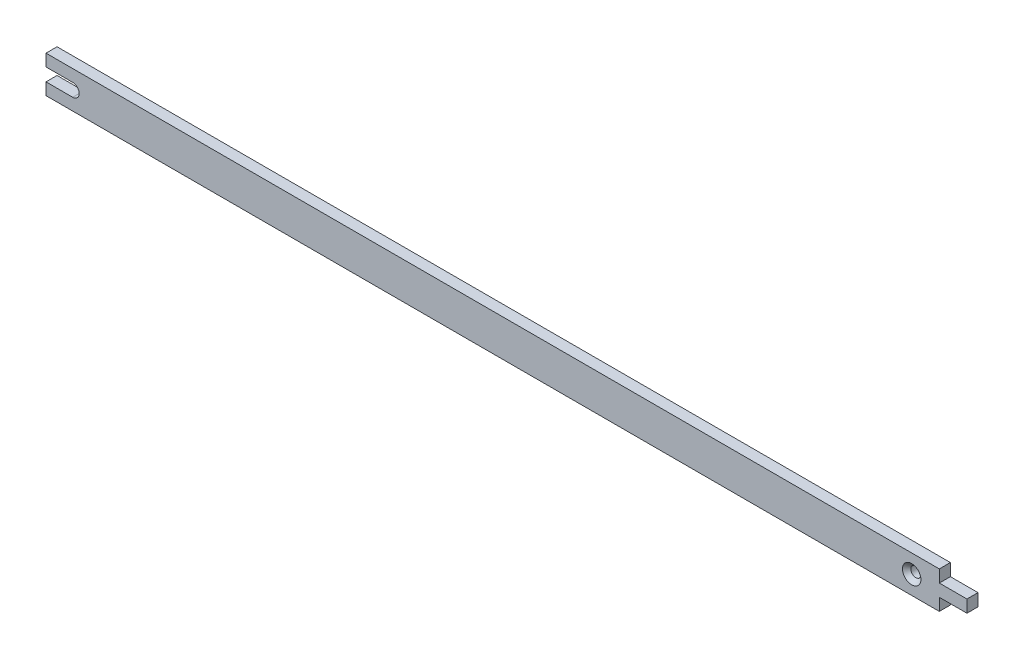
ISO-10303-21;
HEADER;
FILE_DESCRIPTION(('STEP AP214'),'2;1');
FILE_NAME('part.step','',(''),(''),'','','');
FILE_SCHEMA(('AUTOMOTIVE_DESIGN { 1 0 10303 214 1 1 1 1 }'));
ENDSEC;
DATA;
#1=APPLICATION_CONTEXT('core data for automotive mechanical design processes');
#2=APPLICATION_PROTOCOL_DEFINITION('international standard','automotive_design',2000,#1);
#3=PRODUCT_CONTEXT('',#1,'mechanical');
#4=PRODUCT('Part','Part','',(#3));
#5=PRODUCT_RELATED_PRODUCT_CATEGORY('part','',(#4));
#6=PRODUCT_DEFINITION_FORMATION('','',#4);
#7=PRODUCT_DEFINITION_CONTEXT('part definition',#1,'design');
#8=PRODUCT_DEFINITION('design','',#6,#7);
#9=PRODUCT_DEFINITION_SHAPE('','',#8);
#10=(LENGTH_UNIT() NAMED_UNIT(*) SI_UNIT(.MILLI.,.METRE.));
#11=(NAMED_UNIT(*) PLANE_ANGLE_UNIT() SI_UNIT($,.RADIAN.));
#12=(NAMED_UNIT(*) SI_UNIT($,.STERADIAN.) SOLID_ANGLE_UNIT());
#13=UNCERTAINTY_MEASURE_WITH_UNIT(LENGTH_MEASURE(1.E-05),#10,'distance_accuracy_value','');
#14=(GEOMETRIC_REPRESENTATION_CONTEXT(3) GLOBAL_UNCERTAINTY_ASSIGNED_CONTEXT((#13)) GLOBAL_UNIT_ASSIGNED_CONTEXT((#10,
#11,#12)) REPRESENTATION_CONTEXT('',''));
#15=CARTESIAN_POINT('',(0.,0.,0.));
#16=DIRECTION('',(0.,0.,1.));
#17=DIRECTION('',(1.,0.,0.));
#18=AXIS2_PLACEMENT_3D('',#15,#16,#17);
#19=CARTESIAN_POINT('',(15.,3.5,6.));
#20=DIRECTION('',(0.,0.,1.));
#21=DIRECTION('',(0.,1.,0.));
#22=AXIS2_PLACEMENT_3D('',#19,#20,#21);
#23=PLANE('',#22);
#24=DIRECTION('',(0.,1.,0.));
#25=VECTOR('',#24,1.);
#26=CARTESIAN_POINT('',(-470.,-43.8145907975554,6.));
#27=LINE('',#26,#25);
#28=CARTESIAN_POINT('',(-470.,-10.,6.));
#29=VERTEX_POINT('',#28);
#30=CARTESIAN_POINT('',(-470.,-3.5,6.));
#31=VERTEX_POINT('',#30);
#32=EDGE_CURVE('E105',#29,#31,#27,.T.);
#33=ORIENTED_EDGE('',*,*,#32,.F.);
#34=DIRECTION('',(1.,0.,0.));
#35=VECTOR('',#34,1.);
#36=CARTESIAN_POINT('',(15.,-10.,6.));
#37=LINE('',#36,#35);
#38=CARTESIAN_POINT('',(15.,-10.,6.));
#39=VERTEX_POINT('',#38);
#40=EDGE_CURVE('E116',#29,#39,#37,.T.);
#41=ORIENTED_EDGE('',*,*,#40,.T.);
#42=DIRECTION('',(0.,1.,0.));
#43=VECTOR('',#42,1.);
#44=CARTESIAN_POINT('',(15.,-3.35,6.));
#45=LINE('',#44,#43);
#46=CARTESIAN_POINT('',(15.,-3.35,6.));
#47=VERTEX_POINT('',#46);
#48=EDGE_CURVE('E128',#39,#47,#45,.T.);
#49=ORIENTED_EDGE('',*,*,#48,.T.);
#50=DIRECTION('',(1.,0.,0.));
#51=VECTOR('',#50,1.);
#52=CARTESIAN_POINT('',(30.,-3.35,6.));
#53=LINE('',#52,#51);
#54=CARTESIAN_POINT('',(30.,-3.35,6.));
#55=VERTEX_POINT('',#54);
#56=EDGE_CURVE('E131',#47,#55,#53,.T.);
#57=ORIENTED_EDGE('',*,*,#56,.T.);
#58=DIRECTION('',(0.,1.,0.));
#59=VECTOR('',#58,1.);
#60=CARTESIAN_POINT('',(30.,-3.35,6.));
#61=LINE('',#60,#59);
#62=CARTESIAN_POINT('',(30.,3.35,6.));
#63=VERTEX_POINT('',#62);
#64=EDGE_CURVE('E34',#55,#63,#61,.T.);
#65=ORIENTED_EDGE('',*,*,#64,.T.);
#66=DIRECTION('',(-1.,0.,0.));
#67=VECTOR('',#66,1.);
#68=CARTESIAN_POINT('',(30.,3.35,6.));
#69=LINE('',#68,#67);
#70=CARTESIAN_POINT('',(15.,3.35,6.));
#71=VERTEX_POINT('',#70);
#72=EDGE_CURVE('E29',#63,#71,#69,.T.);
#73=ORIENTED_EDGE('',*,*,#72,.T.);
#74=DIRECTION('',(0.,1.,0.));
#75=VECTOR('',#74,1.);
#76=CARTESIAN_POINT('',(15.,3.35,6.));
#77=LINE('',#76,#75);
#78=CARTESIAN_POINT('',(15.,10.,6.));
#79=VERTEX_POINT('',#78);
#80=EDGE_CURVE('E134',#71,#79,#77,.T.);
#81=ORIENTED_EDGE('',*,*,#80,.T.);
#82=DIRECTION('',(-1.,0.,0.));
#83=VECTOR('',#82,1.);
#84=CARTESIAN_POINT('',(15.,10.,6.));
#85=LINE('',#84,#83);
#86=CARTESIAN_POINT('',(-470.,10.,6.));
#87=VERTEX_POINT('',#86);
#88=EDGE_CURVE('E129',#79,#87,#85,.T.);
#89=ORIENTED_EDGE('',*,*,#88,.T.);
#90=CARTESIAN_POINT('',(-470.,3.5,6.));
#91=VERTEX_POINT('',#90);
#92=EDGE_CURVE('E122',#91,#87,#27,.T.);
#93=ORIENTED_EDGE('',*,*,#92,.F.);
#94=DIRECTION('',(-1.,0.,0.));
#95=VECTOR('',#94,1.);
#96=CARTESIAN_POINT('',(-455.5,3.5,6.));
#97=LINE('',#96,#95);
#98=CARTESIAN_POINT('',(-455.5,3.5,6.));
#99=VERTEX_POINT('',#98);
#100=EDGE_CURVE('E267',#99,#91,#97,.T.);
#101=ORIENTED_EDGE('',*,*,#100,.F.);
#102=CARTESIAN_POINT('',(-455.5,0.,6.));
#103=DIRECTION('',(0.,0.,1.));
#104=DIRECTION('',(-1.,0.,0.));
#105=AXIS2_PLACEMENT_3D('',#102,#103,#104);
#106=CIRCLE('',#105,3.5);
#107=CARTESIAN_POINT('',(-455.5,-3.5,6.));
#108=VERTEX_POINT('',#107);
#109=EDGE_CURVE('E264',#108,#99,#106,.T.);
#110=ORIENTED_EDGE('',*,*,#109,.F.);
#111=DIRECTION('',(1.,0.,0.));
#112=VECTOR('',#111,1.);
#113=CARTESIAN_POINT('',(-470.,-3.5,6.));
#114=LINE('',#113,#112);
#115=EDGE_CURVE('E120',#31,#108,#114,.T.);
#116=ORIENTED_EDGE('',*,*,#115,.F.);
#117=EDGE_LOOP('',(#33,#41,#49,#57,#65,#73,#81,#89,#93,#101,#110,#116));
#118=FACE_BOUND('',#117,.T.);
#119=CARTESIAN_POINT('',(0.,0.,6.));
#120=DIRECTION('',(0.,0.,1.));
#121=DIRECTION('',(0.,1.,0.));
#122=AXIS2_PLACEMENT_3D('',#119,#120,#121);
#123=CIRCLE('',#122,5.);
#124=CARTESIAN_POINT('',(0.,5.,6.));
#125=VERTEX_POINT('',#124);
#126=EDGE_CURVE('E9',#125,#125,#123,.F.);
#127=ORIENTED_EDGE('',*,*,#126,.T.);
#128=EDGE_LOOP('',(#127));
#129=FACE_BOUND('',#128,.T.);
#130=ADVANCED_FACE('F14',(#118,#129),#23,.T.);
#131=CARTESIAN_POINT('',(15.,3.5,0.));
#132=DIRECTION('',(0.,0.,1.));
#133=DIRECTION('',(0.,1.,0.));
#134=AXIS2_PLACEMENT_3D('',#131,#132,#133);
#135=PLANE('',#134);
#136=DIRECTION('',(1.,0.,0.));
#137=VECTOR('',#136,1.);
#138=CARTESIAN_POINT('',(15.,-10.,0.));
#139=LINE('',#138,#137);
#140=CARTESIAN_POINT('',(-470.,-10.,0.));
#141=VERTEX_POINT('',#140);
#142=CARTESIAN_POINT('',(15.,-10.,0.));
#143=VERTEX_POINT('',#142);
#144=EDGE_CURVE('E220',#141,#143,#139,.T.);
#145=ORIENTED_EDGE('',*,*,#144,.F.);
#146=DIRECTION('',(0.,1.,0.));
#147=VECTOR('',#146,1.);
#148=CARTESIAN_POINT('',(-470.,-43.8145907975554,0.));
#149=LINE('',#148,#147);
#150=CARTESIAN_POINT('',(-470.,-3.5,0.));
#151=VERTEX_POINT('',#150);
#152=EDGE_CURVE('E108',#141,#151,#149,.T.);
#153=ORIENTED_EDGE('',*,*,#152,.T.);
#154=DIRECTION('',(1.,0.,0.));
#155=VECTOR('',#154,1.);
#156=CARTESIAN_POINT('',(-470.,-3.5,0.));
#157=LINE('',#156,#155);
#158=CARTESIAN_POINT('',(-455.5,-3.5,0.));
#159=VERTEX_POINT('',#158);
#160=EDGE_CURVE('E248',#151,#159,#157,.T.);
#161=ORIENTED_EDGE('',*,*,#160,.T.);
#162=CARTESIAN_POINT('',(-455.5,0.,0.));
#163=DIRECTION('',(0.,0.,1.));
#164=DIRECTION('',(-1.,0.,0.));
#165=AXIS2_PLACEMENT_3D('',#162,#163,#164);
#166=CIRCLE('',#165,3.5);
#167=CARTESIAN_POINT('',(-455.5,3.5,0.));
#168=VERTEX_POINT('',#167);
#169=EDGE_CURVE('E260',#159,#168,#166,.T.);
#170=ORIENTED_EDGE('',*,*,#169,.T.);
#171=DIRECTION('',(-1.,0.,0.));
#172=VECTOR('',#171,1.);
#173=CARTESIAN_POINT('',(-455.5,3.5,0.));
#174=LINE('',#173,#172);
#175=CARTESIAN_POINT('',(-470.,3.5,0.));
#176=VERTEX_POINT('',#175);
#177=EDGE_CURVE('E255',#168,#176,#174,.T.);
#178=ORIENTED_EDGE('',*,*,#177,.T.);
#179=CARTESIAN_POINT('',(-470.,10.,0.));
#180=VERTEX_POINT('',#179);
#181=EDGE_CURVE('E121',#176,#180,#149,.T.);
#182=ORIENTED_EDGE('',*,*,#181,.T.);
#183=DIRECTION('',(-1.,0.,0.));
#184=VECTOR('',#183,1.);
#185=CARTESIAN_POINT('',(15.,10.,0.));
#186=LINE('',#185,#184);
#187=CARTESIAN_POINT('',(15.,10.,0.));
#188=VERTEX_POINT('',#187);
#189=EDGE_CURVE('E215',#188,#180,#186,.T.);
#190=ORIENTED_EDGE('',*,*,#189,.F.);
#191=DIRECTION('',(0.,1.,0.));
#192=VECTOR('',#191,1.);
#193=CARTESIAN_POINT('',(15.,3.35,0.));
#194=LINE('',#193,#192);
#195=CARTESIAN_POINT('',(15.,3.35,0.));
#196=VERTEX_POINT('',#195);
#197=EDGE_CURVE('E221',#196,#188,#194,.T.);
#198=ORIENTED_EDGE('',*,*,#197,.F.);
#199=DIRECTION('',(-1.,0.,0.));
#200=VECTOR('',#199,1.);
#201=CARTESIAN_POINT('',(30.,3.35,0.));
#202=LINE('',#201,#200);
#203=CARTESIAN_POINT('',(30.,3.35,0.));
#204=VERTEX_POINT('',#203);
#205=EDGE_CURVE('E234',#204,#196,#202,.T.);
#206=ORIENTED_EDGE('',*,*,#205,.F.);
#207=DIRECTION('',(0.,1.,0.));
#208=VECTOR('',#207,1.);
#209=CARTESIAN_POINT('',(30.,-3.35,0.));
#210=LINE('',#209,#208);
#211=CARTESIAN_POINT('',(30.,-3.35,0.));
#212=VERTEX_POINT('',#211);
#213=EDGE_CURVE('E232',#212,#204,#210,.T.);
#214=ORIENTED_EDGE('',*,*,#213,.F.);
#215=DIRECTION('',(1.,0.,0.));
#216=VECTOR('',#215,1.);
#217=CARTESIAN_POINT('',(30.,-3.35,0.));
#218=LINE('',#217,#216);
#219=CARTESIAN_POINT('',(15.,-3.35,0.));
#220=VERTEX_POINT('',#219);
#221=EDGE_CURVE('E230',#220,#212,#218,.T.);
#222=ORIENTED_EDGE('',*,*,#221,.F.);
#223=DIRECTION('',(0.,1.,0.));
#224=VECTOR('',#223,1.);
#225=CARTESIAN_POINT('',(15.,-3.35,0.));
#226=LINE('',#225,#224);
#227=EDGE_CURVE('E223',#143,#220,#226,.T.);
#228=ORIENTED_EDGE('',*,*,#227,.F.);
#229=EDGE_LOOP('',(#145,#153,#161,#170,#178,#182,#190,#198,#206,#214,#222,#228));
#230=FACE_BOUND('',#229,.T.);
#231=CARTESIAN_POINT('',(0.,0.,0.));
#232=DIRECTION('',(0.,0.,1.));
#233=DIRECTION('',(0.,1.,0.));
#234=AXIS2_PLACEMENT_3D('',#231,#232,#233);
#235=CIRCLE('',#234,2.75);
#236=CARTESIAN_POINT('',(0.,2.75,0.));
#237=VERTEX_POINT('',#236);
#238=EDGE_CURVE('E225',#237,#237,#235,.T.);
#239=ORIENTED_EDGE('',*,*,#238,.T.);
#240=EDGE_LOOP('',(#239));
#241=FACE_BOUND('',#240,.T.);
#242=ADVANCED_FACE('F180',(#230,#241),#135,.F.);
#243=CARTESIAN_POINT('',(15.,3.35,6.));
#244=DIRECTION('',(-1.,0.,0.));
#245=DIRECTION('',(0.,-1.,0.));
#246=AXIS2_PLACEMENT_3D('',#243,#244,#245);
#247=PLANE('',#246);
#248=ORIENTED_EDGE('',*,*,#197,.T.);
#249=DIRECTION('',(0.,0.,-1.));
#250=VECTOR('',#249,1.);
#251=CARTESIAN_POINT('',(15.,10.,6.));
#252=LINE('',#251,#250);
#253=EDGE_CURVE('E154',#79,#188,#252,.T.);
#254=ORIENTED_EDGE('',*,*,#253,.F.);
#255=ORIENTED_EDGE('',*,*,#80,.F.);
#256=DIRECTION('',(0.,0.,-1.));
#257=VECTOR('',#256,1.);
#258=CARTESIAN_POINT('',(15.,3.35,6.));
#259=LINE('',#258,#257);
#260=EDGE_CURVE('E141',#71,#196,#259,.T.);
#261=ORIENTED_EDGE('',*,*,#260,.T.);
#262=EDGE_LOOP('',(#248,#254,#255,#261));
#263=FACE_BOUND('',#262,.T.);
#264=ADVANCED_FACE('F16',(#263),#247,.F.);
#265=CARTESIAN_POINT('',(15.,10.,6.));
#266=DIRECTION('',(0.,-1.,0.));
#267=DIRECTION('',(1.,0.,0.));
#268=AXIS2_PLACEMENT_3D('',#265,#266,#267);
#269=PLANE('',#268);
#270=ORIENTED_EDGE('',*,*,#189,.T.);
#271=DIRECTION('',(0.,0.,1.));
#272=VECTOR('',#271,1.);
#273=CARTESIAN_POINT('',(-470.,10.,6.));
#274=LINE('',#273,#272);
#275=EDGE_CURVE('E112',#180,#87,#274,.T.);
#276=ORIENTED_EDGE('',*,*,#275,.T.);
#277=ORIENTED_EDGE('',*,*,#88,.F.);
#278=ORIENTED_EDGE('',*,*,#253,.T.);
#279=EDGE_LOOP('',(#270,#276,#277,#278));
#280=FACE_BOUND('',#279,.T.);
#281=ADVANCED_FACE('F205',(#280),#269,.F.);
#282=CARTESIAN_POINT('',(15.,-10.,6.));
#283=DIRECTION('',(0.,1.,0.));
#284=DIRECTION('',(-1.,0.,0.));
#285=AXIS2_PLACEMENT_3D('',#282,#283,#284);
#286=PLANE('',#285);
#287=ORIENTED_EDGE('',*,*,#40,.F.);
#288=DIRECTION('',(0.,0.,-1.));
#289=VECTOR('',#288,1.);
#290=CARTESIAN_POINT('',(-470.,-10.,6.));
#291=LINE('',#290,#289);
#292=EDGE_CURVE('E102',#29,#141,#291,.T.);
#293=ORIENTED_EDGE('',*,*,#292,.T.);
#294=ORIENTED_EDGE('',*,*,#144,.T.);
#295=DIRECTION('',(0.,0.,-1.));
#296=VECTOR('',#295,1.);
#297=CARTESIAN_POINT('',(15.,-10.,6.));
#298=LINE('',#297,#296);
#299=EDGE_CURVE('E126',#39,#143,#298,.T.);
#300=ORIENTED_EDGE('',*,*,#299,.F.);
#301=EDGE_LOOP('',(#287,#293,#294,#300));
#302=FACE_BOUND('',#301,.T.);
#303=ADVANCED_FACE('F124',(#302),#286,.F.);
#304=CARTESIAN_POINT('',(15.,-3.35,6.));
#305=DIRECTION('',(-1.,0.,0.));
#306=DIRECTION('',(0.,-1.,0.));
#307=AXIS2_PLACEMENT_3D('',#304,#305,#306);
#308=PLANE('',#307);
#309=ORIENTED_EDGE('',*,*,#227,.T.);
#310=DIRECTION('',(0.,0.,-1.));
#311=VECTOR('',#310,1.);
#312=CARTESIAN_POINT('',(15.,-3.35,6.));
#313=LINE('',#312,#311);
#314=EDGE_CURVE('E150',#47,#220,#313,.T.);
#315=ORIENTED_EDGE('',*,*,#314,.F.);
#316=ORIENTED_EDGE('',*,*,#48,.F.);
#317=ORIENTED_EDGE('',*,*,#299,.T.);
#318=EDGE_LOOP('',(#309,#315,#316,#317));
#319=FACE_BOUND('',#318,.T.);
#320=ADVANCED_FACE('F199',(#319),#308,.F.);
#321=CARTESIAN_POINT('',(30.,-3.35,6.));
#322=DIRECTION('',(0.,1.,0.));
#323=DIRECTION('',(-1.,0.,0.));
#324=AXIS2_PLACEMENT_3D('',#321,#322,#323);
#325=PLANE('',#324);
#326=ORIENTED_EDGE('',*,*,#221,.T.);
#327=DIRECTION('',(0.,0.,-1.));
#328=VECTOR('',#327,1.);
#329=CARTESIAN_POINT('',(30.,-3.35,6.));
#330=LINE('',#329,#328);
#331=EDGE_CURVE('E147',#55,#212,#330,.T.);
#332=ORIENTED_EDGE('',*,*,#331,.F.);
#333=ORIENTED_EDGE('',*,*,#56,.F.);
#334=ORIENTED_EDGE('',*,*,#314,.T.);
#335=EDGE_LOOP('',(#326,#332,#333,#334));
#336=FACE_BOUND('',#335,.T.);
#337=ADVANCED_FACE('F195',(#336),#325,.F.);
#338=CARTESIAN_POINT('',(30.,-3.35,6.));
#339=DIRECTION('',(-1.,0.,0.));
#340=DIRECTION('',(0.,-1.,0.));
#341=AXIS2_PLACEMENT_3D('',#338,#339,#340);
#342=PLANE('',#341);
#343=ORIENTED_EDGE('',*,*,#213,.T.);
#344=DIRECTION('',(0.,0.,-1.));
#345=VECTOR('',#344,1.);
#346=CARTESIAN_POINT('',(30.,3.35,6.));
#347=LINE('',#346,#345);
#348=EDGE_CURVE('E144',#63,#204,#347,.T.);
#349=ORIENTED_EDGE('',*,*,#348,.F.);
#350=ORIENTED_EDGE('',*,*,#64,.F.);
#351=ORIENTED_EDGE('',*,*,#331,.T.);
#352=EDGE_LOOP('',(#343,#349,#350,#351));
#353=FACE_BOUND('',#352,.T.);
#354=ADVANCED_FACE('F191',(#353),#342,.F.);
#355=CARTESIAN_POINT('',(30.,3.35,6.));
#356=DIRECTION('',(0.,-1.,0.));
#357=DIRECTION('',(1.,0.,0.));
#358=AXIS2_PLACEMENT_3D('',#355,#356,#357);
#359=PLANE('',#358);
#360=ORIENTED_EDGE('',*,*,#205,.T.);
#361=ORIENTED_EDGE('',*,*,#260,.F.);
#362=ORIENTED_EDGE('',*,*,#72,.F.);
#363=ORIENTED_EDGE('',*,*,#348,.T.);
#364=EDGE_LOOP('',(#360,#361,#362,#363));
#365=FACE_BOUND('',#364,.T.);
#366=ADVANCED_FACE('F176',(#365),#359,.F.);
#367=CARTESIAN_POINT('',(0.,0.,6.));
#368=DIRECTION('',(0.,0.,-1.));
#369=DIRECTION('',(0.,-1.,0.));
#370=AXIS2_PLACEMENT_3D('',#367,#368,#369);
#371=CYLINDRICAL_SURFACE('',#370,2.75);
#372=CARTESIAN_POINT('',(0.,0.,3.75));
#373=DIRECTION('',(0.,0.,1.));
#374=DIRECTION('',(0.,1.,0.));
#375=AXIS2_PLACEMENT_3D('',#372,#373,#374);
#376=CIRCLE('',#375,2.75);
#377=CARTESIAN_POINT('',(0.,2.75,3.75));
#378=VERTEX_POINT('',#377);
#379=EDGE_CURVE('E22',#378,#378,#376,.T.);
#380=ORIENTED_EDGE('',*,*,#379,.T.);
#381=EDGE_LOOP('',(#380));
#382=FACE_BOUND('',#381,.T.);
#383=ORIENTED_EDGE('',*,*,#238,.F.);
#384=EDGE_LOOP('',(#383));
#385=FACE_BOUND('',#384,.T.);
#386=ADVANCED_FACE('F159',(#382,#385),#371,.F.);
#387=CARTESIAN_POINT('',(0.,0.,3.75));
#388=DIRECTION('',(0.,0.,1.));
#389=DIRECTION('',(0.,1.,0.));
#390=AXIS2_PLACEMENT_3D('',#387,#388,#389);
#391=CONICAL_SURFACE('',#390,2.75,0.78539816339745);
#392=ORIENTED_EDGE('',*,*,#126,.F.);
#393=EDGE_LOOP('',(#392));
#394=FACE_BOUND('',#393,.T.);
#395=ORIENTED_EDGE('',*,*,#379,.F.);
#396=EDGE_LOOP('',(#395));
#397=FACE_BOUND('',#396,.T.);
#398=ADVANCED_FACE('F162',(#394,#397),#391,.F.);
#399=CARTESIAN_POINT('',(-455.5,0.,0.));
#400=DIRECTION('',(0.,0.,1.));
#401=DIRECTION('',(-1.,0.,0.));
#402=AXIS2_PLACEMENT_3D('',#399,#400,#401);
#403=CYLINDRICAL_SURFACE('',#402,3.5);
#404=ORIENTED_EDGE('',*,*,#109,.T.);
#405=DIRECTION('',(0.,0.,1.));
#406=VECTOR('',#405,1.);
#407=CARTESIAN_POINT('',(-455.5,3.5,0.));
#408=LINE('',#407,#406);
#409=EDGE_CURVE('E254',#168,#99,#408,.T.);
#410=ORIENTED_EDGE('',*,*,#409,.F.);
#411=ORIENTED_EDGE('',*,*,#169,.F.);
#412=DIRECTION('',(0.,0.,1.));
#413=VECTOR('',#412,1.);
#414=CARTESIAN_POINT('',(-455.5,-3.5,0.));
#415=LINE('',#414,#413);
#416=EDGE_CURVE('E252',#159,#108,#415,.T.);
#417=ORIENTED_EDGE('',*,*,#416,.T.);
#418=EDGE_LOOP('',(#404,#410,#411,#417));
#419=FACE_BOUND('',#418,.T.);
#420=ADVANCED_FACE('F164',(#419),#403,.F.);
#421=CARTESIAN_POINT('',(-470.,-3.5,0.));
#422=DIRECTION('',(0.,-1.,0.));
#423=DIRECTION('',(0.,0.,1.));
#424=AXIS2_PLACEMENT_3D('',#421,#422,#423);
#425=PLANE('',#424);
#426=ORIENTED_EDGE('',*,*,#115,.T.);
#427=ORIENTED_EDGE('',*,*,#416,.F.);
#428=ORIENTED_EDGE('',*,*,#160,.F.);
#429=DIRECTION('',(0.,0.,1.));
#430=VECTOR('',#429,1.);
#431=CARTESIAN_POINT('',(-470.,-3.5,0.));
#432=LINE('',#431,#430);
#433=EDGE_CURVE('E251',#151,#31,#432,.T.);
#434=ORIENTED_EDGE('',*,*,#433,.T.);
#435=EDGE_LOOP('',(#426,#427,#428,#434));
#436=FACE_BOUND('',#435,.T.);
#437=ADVANCED_FACE('F173',(#436),#425,.F.);
#438=CARTESIAN_POINT('',(-455.5,3.5,0.));
#439=DIRECTION('',(0.,1.,0.));
#440=DIRECTION('',(0.,0.,-1.));
#441=AXIS2_PLACEMENT_3D('',#438,#439,#440);
#442=PLANE('',#441);
#443=ORIENTED_EDGE('',*,*,#100,.T.);
#444=DIRECTION('',(0.,0.,1.));
#445=VECTOR('',#444,1.);
#446=CARTESIAN_POINT('',(-470.,3.5,0.));
#447=LINE('',#446,#445);
#448=EDGE_CURVE('E257',#176,#91,#447,.T.);
#449=ORIENTED_EDGE('',*,*,#448,.F.);
#450=ORIENTED_EDGE('',*,*,#177,.F.);
#451=ORIENTED_EDGE('',*,*,#409,.T.);
#452=EDGE_LOOP('',(#443,#449,#450,#451));
#453=FACE_BOUND('',#452,.T.);
#454=ADVANCED_FACE('F281',(#453),#442,.F.);
#455=CARTESIAN_POINT('',(-470.,-43.8145907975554,0.));
#456=DIRECTION('',(1.,0.,0.));
#457=DIRECTION('',(0.,0.,1.));
#458=AXIS2_PLACEMENT_3D('',#455,#456,#457);
#459=PLANE('',#458);
#460=ORIENTED_EDGE('',*,*,#181,.F.);
#461=ORIENTED_EDGE('',*,*,#448,.T.);
#462=ORIENTED_EDGE('',*,*,#92,.T.);
#463=ORIENTED_EDGE('',*,*,#275,.F.);
#464=EDGE_LOOP('',(#460,#461,#462,#463));
#465=FACE_BOUND('',#464,.T.);
#466=ADVANCED_FACE('F277',(#465),#459,.F.);
#467=ORIENTED_EDGE('',*,*,#32,.T.);
#468=ORIENTED_EDGE('',*,*,#433,.F.);
#469=ORIENTED_EDGE('',*,*,#152,.F.);
#470=ORIENTED_EDGE('',*,*,#292,.F.);
#471=EDGE_LOOP('',(#467,#468,#469,#470));
#472=FACE_BOUND('',#471,.T.);
#473=ADVANCED_FACE('F104',(#472),#459,.F.);
#474=CLOSED_SHELL('',(#130,#242,#264,#281,#303,#320,#337,#354,#366,#386,#398,#420,#437,#454,
#466,#473));
#475=MANIFOLD_SOLID_BREP('B1',#474);
#476=ADVANCED_BREP_SHAPE_REPRESENTATION('',(#18,#475),#14);
#477=SHAPE_DEFINITION_REPRESENTATION(#9,#476);
ENDSEC;
END-ISO-10303-21;
